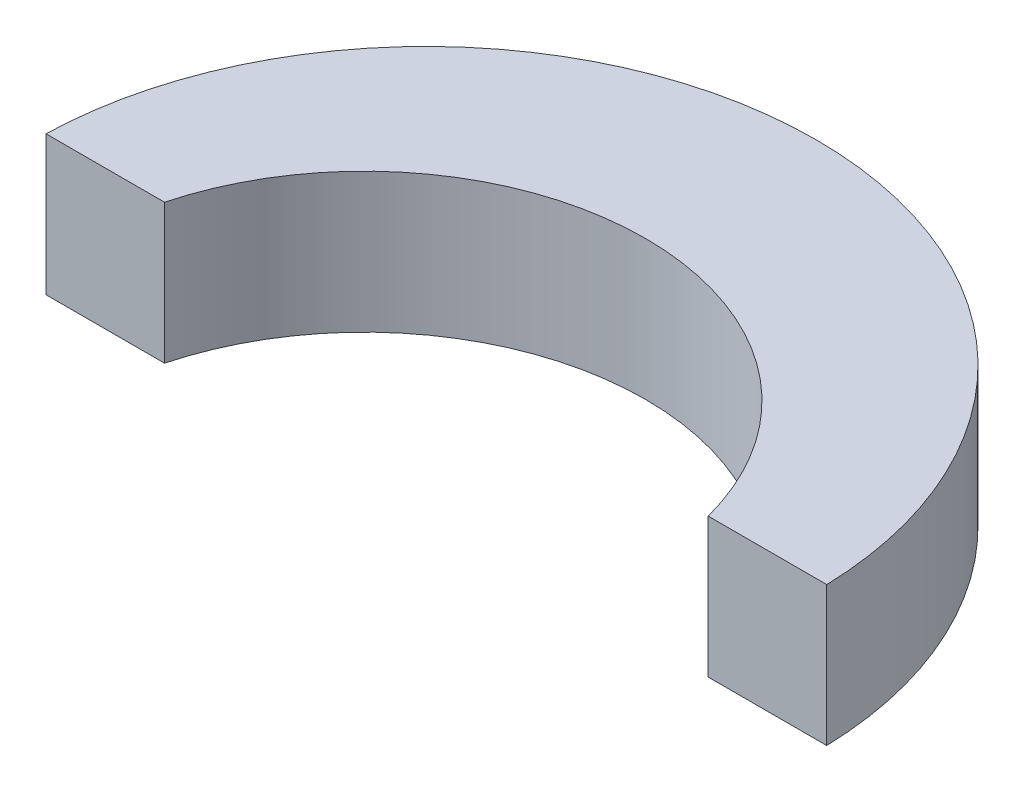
from build123d import *

# Parameters (mm, degrees)
AUFSATZ_LINEAR_AUSTRAGEN1_DEPTH = 10


with BuildPart() as part:
    # Skizze1 → Aufsatz-Linear austragen1 (new, symmetric)
    with BuildSketch(Plane(origin=(0, 0, 0), x_dir=(1, 0, 0), z_dir=(0, 1, 0))):
        with BuildLine():
            Line((-56, 0), (-39, 0))
            ThreePointArc((-39, 0), (-24.6018292, 21.63237796), (0, 30))
            ThreePointArc((0, 30), (24.6018292, 21.63237796), (39, 0))
            Line((39, 0), (56, 0))
            ThreePointArc((56, 0), (39.07124902, 38.625962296), (0, 54.5))
            ThreePointArc((0, 54.5), (-39.07124902, 38.625962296), (-56, 0))
        make_face()
    extrude(amount=AUFSATZ_LINEAR_AUSTRAGEN1_DEPTH, both=True)


solid = part.part
